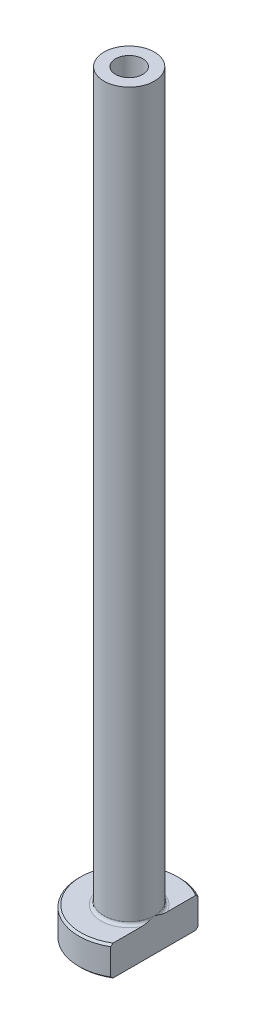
from build123d import *

# Parameters (mm, degrees)
FILLET1_R          = 0.3
CHAMFER1_SIZE      = 0.2
CUT_EXTRUDE1_DEPTH = 76.332595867
CHAMFER2_SIZE      = 0.5


with BuildPart() as part:
    # Sketch1 → Revolve1 (revolve)
    with BuildSketch(Plane.XY, mode=Mode.PRIVATE) as revolve1_sk:
        Polygon((-1.35, 75), (-2.5, 75), (-2.5, 3), (-5, 3), (-5, 0), (-1.6, 0), (-1.6, 18), (-1.35, 30), align=None)
    revolve(revolve1_sk.sketch.rotate(Axis((0, 92.187680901, 0), (0, -1, 0)), 270), axis=Axis((0, 92.187680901, 0), (0, -1, 0)))

    # Fillet1
    fillet1_edges = [part.edges().sort_by_distance(p)[0] for p in [
        (0, 3, -2.5),
    ]]
    fillet(fillet1_edges, radius=FILLET1_R)

    # Chamfer1
    chamfer1_edges = [part.edges().sort_by_distance(p)[0] for p in [
        (0, 0, -5),
        (0, 3, -5),
    ]]
    chamfer(chamfer1_edges, length=CHAMFER1_SIZE)

    # Sketch2 → Cut-Extrude1 (cut, through all)
    with BuildSketch(Plane.XZ):
        with BuildLine():
            Line((2.5, 4.330127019), (2.5, -4.330127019))
            ThreePointArc((2.5, -4.330127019), (5, 0), (2.5, 4.330127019))
        make_face()
    extrude(amount=-CUT_EXTRUDE1_DEPTH, mode=Mode.SUBTRACT)

    # Chamfer2
    chamfer2_edges = [part.edges().sort_by_distance(p)[0] for p in [
        (0, 0, -1.6),
    ]]
    chamfer(chamfer2_edges, length=CHAMFER2_SIZE)


solid = part.part
